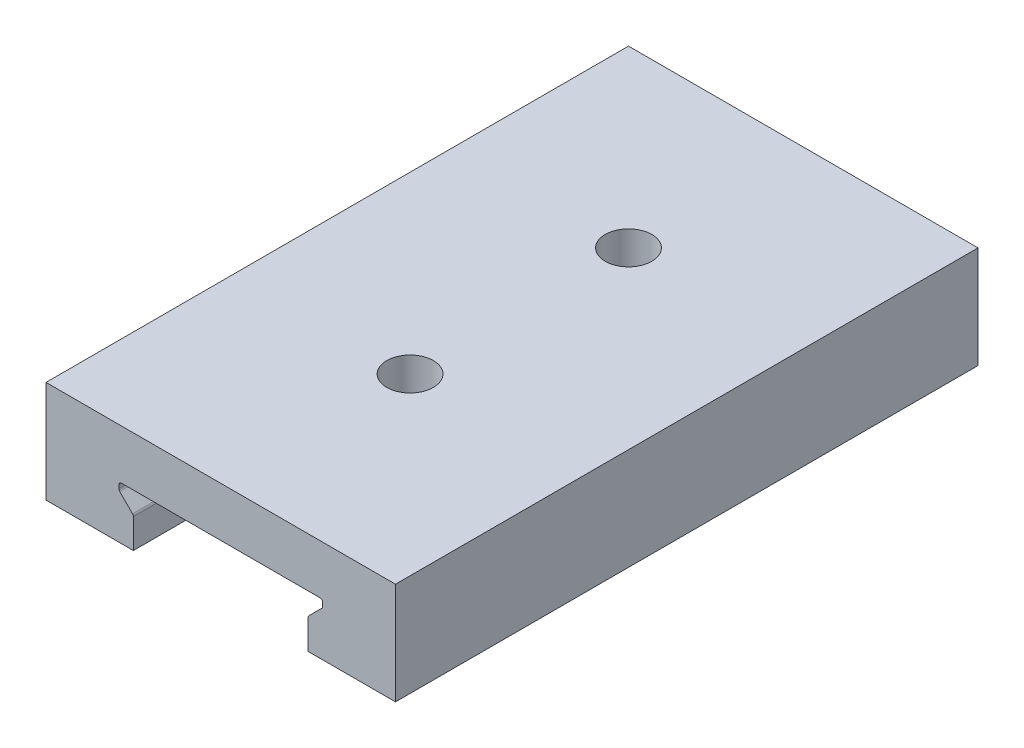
ISO-10303-21;
HEADER;
FILE_DESCRIPTION(('STEP AP214'),'2;1');
FILE_NAME('part.step','',(''),(''),'','','');
FILE_SCHEMA(('AUTOMOTIVE_DESIGN { 1 0 10303 214 1 1 1 1 }'));
ENDSEC;
DATA;
#1=APPLICATION_CONTEXT('core data for automotive mechanical design processes');
#2=APPLICATION_PROTOCOL_DEFINITION('international standard','automotive_design',2000,#1);
#3=PRODUCT_CONTEXT('',#1,'mechanical');
#4=PRODUCT('Part','Part','',(#3));
#5=PRODUCT_RELATED_PRODUCT_CATEGORY('part','',(#4));
#6=PRODUCT_DEFINITION_FORMATION('','',#4);
#7=PRODUCT_DEFINITION_CONTEXT('part definition',#1,'design');
#8=PRODUCT_DEFINITION('design','',#6,#7);
#9=PRODUCT_DEFINITION_SHAPE('','',#8);
#10=(LENGTH_UNIT() NAMED_UNIT(*) SI_UNIT(.MILLI.,.METRE.));
#11=(NAMED_UNIT(*) PLANE_ANGLE_UNIT() SI_UNIT($,.RADIAN.));
#12=(NAMED_UNIT(*) SI_UNIT($,.STERADIAN.) SOLID_ANGLE_UNIT());
#13=UNCERTAINTY_MEASURE_WITH_UNIT(LENGTH_MEASURE(1.E-05),#10,'distance_accuracy_value','');
#14=(GEOMETRIC_REPRESENTATION_CONTEXT(3) GLOBAL_UNCERTAINTY_ASSIGNED_CONTEXT((#13)) GLOBAL_UNIT_ASSIGNED_CONTEXT((#10,
#11,#12)) REPRESENTATION_CONTEXT('',''));
#15=CARTESIAN_POINT('',(0.,0.,0.));
#16=DIRECTION('',(0.,0.,1.));
#17=DIRECTION('',(1.,0.,0.));
#18=AXIS2_PLACEMENT_3D('',#15,#16,#17);
#19=CARTESIAN_POINT('',(-6.,1.,20.));
#20=DIRECTION('',(0.,1.,0.));
#21=DIRECTION('',(0.,0.,1.));
#22=AXIS2_PLACEMENT_3D('',#19,#20,#21);
#23=PLANE('',#22);
#24=DIRECTION('',(0.,0.,1.));
#25=VECTOR('',#24,1.);
#26=CARTESIAN_POINT('',(3.,1.,20.));
#27=LINE('',#26,#25);
#28=CARTESIAN_POINT('',(3.,1.,0.));
#29=VERTEX_POINT('',#28);
#30=CARTESIAN_POINT('',(3.,1.,20.));
#31=VERTEX_POINT('',#30);
#32=EDGE_CURVE('E161',#29,#31,#27,.T.);
#33=ORIENTED_EDGE('',*,*,#32,.F.);
#34=DIRECTION('',(1.,0.,0.));
#35=VECTOR('',#34,1.);
#36=CARTESIAN_POINT('',(-6.,1.,0.));
#37=LINE('',#36,#35);
#38=CARTESIAN_POINT('',(6.,1.,0.));
#39=VERTEX_POINT('',#38);
#40=EDGE_CURVE('E173',#29,#39,#37,.T.);
#41=ORIENTED_EDGE('',*,*,#40,.T.);
#42=DIRECTION('',(0.,0.,-1.));
#43=VECTOR('',#42,1.);
#44=CARTESIAN_POINT('',(6.,1.,20.));
#45=LINE('',#44,#43);
#46=CARTESIAN_POINT('',(6.,1.,20.));
#47=VERTEX_POINT('',#46);
#48=EDGE_CURVE('E211',#47,#39,#45,.T.);
#49=ORIENTED_EDGE('',*,*,#48,.F.);
#50=DIRECTION('',(1.,0.,0.));
#51=VECTOR('',#50,1.);
#52=CARTESIAN_POINT('',(-6.,1.,20.));
#53=LINE('',#52,#51);
#54=EDGE_CURVE('E175',#31,#47,#53,.T.);
#55=ORIENTED_EDGE('',*,*,#54,.F.);
#56=EDGE_LOOP('',(#33,#41,#49,#55));
#57=FACE_BOUND('',#56,.T.);
#58=ADVANCED_FACE('F30',(#57),#23,.F.);
#59=CARTESIAN_POINT('',(-6.,1.,20.));
#60=DIRECTION('',(0.,0.,1.));
#61=DIRECTION('',(1.,0.,0.));
#62=AXIS2_PLACEMENT_3D('',#59,#60,#61);
#63=PLANE('',#62);
#64=DIRECTION('',(0.707106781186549,0.707106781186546,0.));
#65=VECTOR('',#64,1.);
#66=CARTESIAN_POINT('',(3.5,2.55,20.));
#67=LINE('',#66,#65);
#68=CARTESIAN_POINT('',(3.02928932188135,2.07928932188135,20.));
#69=VERTEX_POINT('',#68);
#70=CARTESIAN_POINT('',(3.47071067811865,2.52071067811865,20.));
#71=VERTEX_POINT('',#70);
#72=EDGE_CURVE('E284',#69,#71,#67,.T.);
#73=ORIENTED_EDGE('',*,*,#72,.F.);
#74=CARTESIAN_POINT('',(3.1,2.00857864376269,20.));
#75=DIRECTION('',(0.,0.,1.));
#76=DIRECTION('',(1.,0.,0.));
#77=AXIS2_PLACEMENT_3D('',#74,#75,#76);
#78=CIRCLE('',#77,0.1);
#79=CARTESIAN_POINT('',(3.,2.00857864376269,20.));
#80=VERTEX_POINT('',#79);
#81=EDGE_CURVE('E253',#69,#80,#78,.T.);
#82=ORIENTED_EDGE('',*,*,#81,.T.);
#83=DIRECTION('',(0.,1.,0.));
#84=VECTOR('',#83,1.);
#85=CARTESIAN_POINT('',(3.,2.05,20.));
#86=LINE('',#85,#84);
#87=EDGE_CURVE('E177',#31,#80,#86,.T.);
#88=ORIENTED_EDGE('',*,*,#87,.F.);
#89=ORIENTED_EDGE('',*,*,#54,.T.);
#90=DIRECTION('',(0.,1.,0.));
#91=VECTOR('',#90,1.);
#92=CARTESIAN_POINT('',(6.,4.5,20.));
#93=LINE('',#92,#91);
#94=CARTESIAN_POINT('',(6.,4.5,20.));
#95=VERTEX_POINT('',#94);
#96=EDGE_CURVE('E201',#47,#95,#93,.T.);
#97=ORIENTED_EDGE('',*,*,#96,.T.);
#98=DIRECTION('',(-1.,0.,0.));
#99=VECTOR('',#98,1.);
#100=CARTESIAN_POINT('',(-6.,4.5,20.));
#101=LINE('',#100,#99);
#102=CARTESIAN_POINT('',(-6.,4.5,20.));
#103=VERTEX_POINT('',#102);
#104=EDGE_CURVE('E203',#95,#103,#101,.T.);
#105=ORIENTED_EDGE('',*,*,#104,.T.);
#106=DIRECTION('',(0.,-1.,0.));
#107=VECTOR('',#106,1.);
#108=CARTESIAN_POINT('',(-6.,4.5,20.));
#109=LINE('',#108,#107);
#110=CARTESIAN_POINT('',(-6.,1.,20.));
#111=VERTEX_POINT('',#110);
#112=EDGE_CURVE('E195',#103,#111,#109,.T.);
#113=ORIENTED_EDGE('',*,*,#112,.T.);
#114=CARTESIAN_POINT('',(-3.,1.,20.));
#115=VERTEX_POINT('',#114);
#116=EDGE_CURVE('E198',#111,#115,#53,.T.);
#117=ORIENTED_EDGE('',*,*,#116,.T.);
#118=DIRECTION('',(0.,1.,0.));
#119=VECTOR('',#118,1.);
#120=CARTESIAN_POINT('',(-3.,2.05,20.));
#121=LINE('',#120,#119);
#122=CARTESIAN_POINT('',(-3.,2.00857864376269,20.));
#123=VERTEX_POINT('',#122);
#124=EDGE_CURVE('E296',#115,#123,#121,.T.);
#125=ORIENTED_EDGE('',*,*,#124,.T.);
#126=CARTESIAN_POINT('',(-3.1,2.00857864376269,20.));
#127=DIRECTION('',(0.,0.,1.));
#128=DIRECTION('',(1.,0.,0.));
#129=AXIS2_PLACEMENT_3D('',#126,#127,#128);
#130=CIRCLE('',#129,0.1);
#131=CARTESIAN_POINT('',(-3.02928932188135,2.07928932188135,20.));
#132=VERTEX_POINT('',#131);
#133=EDGE_CURVE('E227',#123,#132,#130,.T.);
#134=ORIENTED_EDGE('',*,*,#133,.T.);
#135=DIRECTION('',(-0.707106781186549,0.707106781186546,0.));
#136=VECTOR('',#135,1.);
#137=CARTESIAN_POINT('',(-3.5,2.55,20.));
#138=LINE('',#137,#136);
#139=CARTESIAN_POINT('',(-3.47071067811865,2.52071067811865,20.));
#140=VERTEX_POINT('',#139);
#141=EDGE_CURVE('E299',#132,#140,#138,.T.);
#142=ORIENTED_EDGE('',*,*,#141,.T.);
#143=CARTESIAN_POINT('',(-3.4,2.59142135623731,20.));
#144=DIRECTION('',(0.,0.,1.));
#145=DIRECTION('',(1.,0.,0.));
#146=AXIS2_PLACEMENT_3D('',#143,#144,#145);
#147=CIRCLE('',#146,0.1);
#148=CARTESIAN_POINT('',(-3.5,2.59142135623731,20.));
#149=VERTEX_POINT('',#148);
#150=EDGE_CURVE('E239',#140,#149,#147,.F.);
#151=ORIENTED_EDGE('',*,*,#150,.T.);
#152=DIRECTION('',(0.,1.,0.));
#153=VECTOR('',#152,1.);
#154=CARTESIAN_POINT('',(-3.5,2.8,20.));
#155=LINE('',#154,#153);
#156=CARTESIAN_POINT('',(-3.5,2.7,20.));
#157=VERTEX_POINT('',#156);
#158=EDGE_CURVE('E302',#149,#157,#155,.T.);
#159=ORIENTED_EDGE('',*,*,#158,.T.);
#160=CARTESIAN_POINT('',(-3.4,2.7,20.));
#161=DIRECTION('',(0.,0.,1.));
#162=DIRECTION('',(1.,0.,0.));
#163=AXIS2_PLACEMENT_3D('',#160,#161,#162);
#164=CIRCLE('',#163,0.1);
#165=CARTESIAN_POINT('',(-3.4,2.8,20.));
#166=VERTEX_POINT('',#165);
#167=EDGE_CURVE('E243',#157,#166,#164,.F.);
#168=ORIENTED_EDGE('',*,*,#167,.T.);
#169=DIRECTION('',(1.,0.,0.));
#170=VECTOR('',#169,1.);
#171=CARTESIAN_POINT('',(0.,2.8,20.));
#172=LINE('',#171,#170);
#173=CARTESIAN_POINT('',(3.4,2.8,20.));
#174=VERTEX_POINT('',#173);
#175=EDGE_CURVE('E305',#166,#174,#172,.T.);
#176=ORIENTED_EDGE('',*,*,#175,.T.);
#177=CARTESIAN_POINT('',(3.4,2.7,20.));
#178=DIRECTION('',(0.,0.,1.));
#179=DIRECTION('',(1.,0.,0.));
#180=AXIS2_PLACEMENT_3D('',#177,#178,#179);
#181=CIRCLE('',#180,0.1);
#182=CARTESIAN_POINT('',(3.5,2.7,20.));
#183=VERTEX_POINT('',#182);
#184=EDGE_CURVE('E11',#174,#183,#181,.F.);
#185=ORIENTED_EDGE('',*,*,#184,.T.);
#186=DIRECTION('',(0.,1.,0.));
#187=VECTOR('',#186,1.);
#188=CARTESIAN_POINT('',(3.5,2.8,20.));
#189=LINE('',#188,#187);
#190=CARTESIAN_POINT('',(3.5,2.59142135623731,20.));
#191=VERTEX_POINT('',#190);
#192=EDGE_CURVE('E167',#191,#183,#189,.T.);
#193=ORIENTED_EDGE('',*,*,#192,.F.);
#194=CARTESIAN_POINT('',(3.4,2.59142135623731,20.));
#195=DIRECTION('',(0.,0.,1.));
#196=DIRECTION('',(1.,0.,0.));
#197=AXIS2_PLACEMENT_3D('',#194,#195,#196);
#198=CIRCLE('',#197,0.1);
#199=EDGE_CURVE('E263',#191,#71,#198,.F.);
#200=ORIENTED_EDGE('',*,*,#199,.T.);
#201=EDGE_LOOP('',(#73,#82,#88,#89,#97,#105,#113,#117,#125,#134,#142,#151,#159,#168,#176,#185,
#193,#200));
#202=FACE_BOUND('',#201,.T.);
#203=ADVANCED_FACE('F313',(#202),#63,.T.);
#204=CARTESIAN_POINT('',(-6.,1.,0.));
#205=DIRECTION('',(0.,0.,1.));
#206=DIRECTION('',(1.,0.,0.));
#207=AXIS2_PLACEMENT_3D('',#204,#205,#206);
#208=PLANE('',#207);
#209=DIRECTION('',(0.,1.,0.));
#210=VECTOR('',#209,1.);
#211=CARTESIAN_POINT('',(3.,2.05,0.));
#212=LINE('',#211,#210);
#213=CARTESIAN_POINT('',(3.,2.00857864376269,0.));
#214=VERTEX_POINT('',#213);
#215=EDGE_CURVE('E157',#29,#214,#212,.T.);
#216=ORIENTED_EDGE('',*,*,#215,.T.);
#217=CARTESIAN_POINT('',(3.1,2.00857864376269,0.));
#218=DIRECTION('',(0.,0.,1.));
#219=DIRECTION('',(1.,0.,0.));
#220=AXIS2_PLACEMENT_3D('',#217,#218,#219);
#221=CIRCLE('',#220,0.1);
#222=CARTESIAN_POINT('',(3.02928932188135,2.07928932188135,0.));
#223=VERTEX_POINT('',#222);
#224=EDGE_CURVE('E246',#214,#223,#221,.F.);
#225=ORIENTED_EDGE('',*,*,#224,.T.);
#226=DIRECTION('',(0.707106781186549,0.707106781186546,0.));
#227=VECTOR('',#226,1.);
#228=CARTESIAN_POINT('',(3.5,2.55,0.));
#229=LINE('',#228,#227);
#230=CARTESIAN_POINT('',(3.47071067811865,2.52071067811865,0.));
#231=VERTEX_POINT('',#230);
#232=EDGE_CURVE('E168',#223,#231,#229,.T.);
#233=ORIENTED_EDGE('',*,*,#232,.T.);
#234=CARTESIAN_POINT('',(3.4,2.59142135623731,0.));
#235=DIRECTION('',(0.,0.,1.));
#236=DIRECTION('',(1.,0.,0.));
#237=AXIS2_PLACEMENT_3D('',#234,#235,#236);
#238=CIRCLE('',#237,0.1);
#239=CARTESIAN_POINT('',(3.5,2.59142135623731,0.));
#240=VERTEX_POINT('',#239);
#241=EDGE_CURVE('E261',#231,#240,#238,.T.);
#242=ORIENTED_EDGE('',*,*,#241,.T.);
#243=DIRECTION('',(0.,1.,0.));
#244=VECTOR('',#243,1.);
#245=CARTESIAN_POINT('',(3.5,2.8,0.));
#246=LINE('',#245,#244);
#247=CARTESIAN_POINT('',(3.5,2.7,0.));
#248=VERTEX_POINT('',#247);
#249=EDGE_CURVE('E267',#240,#248,#246,.T.);
#250=ORIENTED_EDGE('',*,*,#249,.T.);
#251=CARTESIAN_POINT('',(3.4,2.7,0.));
#252=DIRECTION('',(0.,0.,1.));
#253=DIRECTION('',(1.,0.,0.));
#254=AXIS2_PLACEMENT_3D('',#251,#252,#253);
#255=CIRCLE('',#254,0.1);
#256=CARTESIAN_POINT('',(3.4,2.8,0.));
#257=VERTEX_POINT('',#256);
#258=EDGE_CURVE('E39',#248,#257,#255,.T.);
#259=ORIENTED_EDGE('',*,*,#258,.T.);
#260=DIRECTION('',(1.,0.,0.));
#261=VECTOR('',#260,1.);
#262=CARTESIAN_POINT('',(0.,2.8,0.));
#263=LINE('',#262,#261);
#264=CARTESIAN_POINT('',(-3.4,2.8,0.));
#265=VERTEX_POINT('',#264);
#266=EDGE_CURVE('E293',#265,#257,#263,.T.);
#267=ORIENTED_EDGE('',*,*,#266,.F.);
#268=CARTESIAN_POINT('',(-3.4,2.7,0.));
#269=DIRECTION('',(0.,0.,1.));
#270=DIRECTION('',(1.,0.,0.));
#271=AXIS2_PLACEMENT_3D('',#268,#269,#270);
#272=CIRCLE('',#271,0.1);
#273=CARTESIAN_POINT('',(-3.5,2.7,0.));
#274=VERTEX_POINT('',#273);
#275=EDGE_CURVE('E241',#265,#274,#272,.T.);
#276=ORIENTED_EDGE('',*,*,#275,.T.);
#277=DIRECTION('',(0.,1.,0.));
#278=VECTOR('',#277,1.);
#279=CARTESIAN_POINT('',(-3.5,2.8,0.));
#280=LINE('',#279,#278);
#281=CARTESIAN_POINT('',(-3.5,2.59142135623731,0.));
#282=VERTEX_POINT('',#281);
#283=EDGE_CURVE('E290',#282,#274,#280,.T.);
#284=ORIENTED_EDGE('',*,*,#283,.F.);
#285=CARTESIAN_POINT('',(-3.4,2.59142135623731,0.));
#286=DIRECTION('',(0.,0.,1.));
#287=DIRECTION('',(1.,0.,0.));
#288=AXIS2_PLACEMENT_3D('',#285,#286,#287);
#289=CIRCLE('',#288,0.1);
#290=CARTESIAN_POINT('',(-3.47071067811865,2.52071067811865,0.));
#291=VERTEX_POINT('',#290);
#292=EDGE_CURVE('E237',#282,#291,#289,.T.);
#293=ORIENTED_EDGE('',*,*,#292,.T.);
#294=DIRECTION('',(-0.707106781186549,0.707106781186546,0.));
#295=VECTOR('',#294,1.);
#296=CARTESIAN_POINT('',(-3.5,2.55,0.));
#297=LINE('',#296,#295);
#298=CARTESIAN_POINT('',(-3.02928932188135,2.07928932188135,0.));
#299=VERTEX_POINT('',#298);
#300=EDGE_CURVE('E176',#299,#291,#297,.T.);
#301=ORIENTED_EDGE('',*,*,#300,.F.);
#302=CARTESIAN_POINT('',(-3.1,2.00857864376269,0.));
#303=DIRECTION('',(0.,0.,1.));
#304=DIRECTION('',(1.,0.,0.));
#305=AXIS2_PLACEMENT_3D('',#302,#303,#304);
#306=CIRCLE('',#305,0.1);
#307=CARTESIAN_POINT('',(-3.,2.00857864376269,0.));
#308=VERTEX_POINT('',#307);
#309=EDGE_CURVE('E223',#299,#308,#306,.F.);
#310=ORIENTED_EDGE('',*,*,#309,.T.);
#311=DIRECTION('',(0.,-1.,0.));
#312=VECTOR('',#311,1.);
#313=CARTESIAN_POINT('',(-3.,0.999999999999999,0.));
#314=LINE('',#313,#312);
#315=CARTESIAN_POINT('',(-3.,1.,0.));
#316=VERTEX_POINT('',#315);
#317=EDGE_CURVE('E216',#308,#316,#314,.T.);
#318=ORIENTED_EDGE('',*,*,#317,.T.);
#319=CARTESIAN_POINT('',(-6.,1.,0.));
#320=VERTEX_POINT('',#319);
#321=EDGE_CURVE('E183',#320,#316,#37,.T.);
#322=ORIENTED_EDGE('',*,*,#321,.F.);
#323=DIRECTION('',(0.,-1.,0.));
#324=VECTOR('',#323,1.);
#325=CARTESIAN_POINT('',(-6.,4.5,0.));
#326=LINE('',#325,#324);
#327=CARTESIAN_POINT('',(-6.,4.5,0.));
#328=VERTEX_POINT('',#327);
#329=EDGE_CURVE('E184',#328,#320,#326,.T.);
#330=ORIENTED_EDGE('',*,*,#329,.F.);
#331=DIRECTION('',(-1.,0.,0.));
#332=VECTOR('',#331,1.);
#333=CARTESIAN_POINT('',(-6.,4.5,0.));
#334=LINE('',#333,#332);
#335=CARTESIAN_POINT('',(6.,4.5,0.));
#336=VERTEX_POINT('',#335);
#337=EDGE_CURVE('E193',#336,#328,#334,.T.);
#338=ORIENTED_EDGE('',*,*,#337,.F.);
#339=DIRECTION('',(0.,1.,0.));
#340=VECTOR('',#339,1.);
#341=CARTESIAN_POINT('',(6.,4.5,0.));
#342=LINE('',#341,#340);
#343=EDGE_CURVE('E182',#39,#336,#342,.T.);
#344=ORIENTED_EDGE('',*,*,#343,.F.);
#345=ORIENTED_EDGE('',*,*,#40,.F.);
#346=EDGE_LOOP('',(#216,#225,#233,#242,#250,#259,#267,#276,#284,#293,#301,#310,#318,#322,#330,
#338,#344,#345));
#347=FACE_BOUND('',#346,.T.);
#348=ADVANCED_FACE('F180',(#347),#208,.F.);
#349=CARTESIAN_POINT('',(-6.,4.5,20.));
#350=DIRECTION('',(1.,0.,0.));
#351=DIRECTION('',(0.,0.,-1.));
#352=AXIS2_PLACEMENT_3D('',#349,#350,#351);
#353=PLANE('',#352);
#354=ORIENTED_EDGE('',*,*,#329,.T.);
#355=DIRECTION('',(0.,0.,-1.));
#356=VECTOR('',#355,1.);
#357=CARTESIAN_POINT('',(-6.,1.,20.));
#358=LINE('',#357,#356);
#359=EDGE_CURVE('E213',#111,#320,#358,.T.);
#360=ORIENTED_EDGE('',*,*,#359,.F.);
#361=ORIENTED_EDGE('',*,*,#112,.F.);
#362=DIRECTION('',(0.,0.,-1.));
#363=VECTOR('',#362,1.);
#364=CARTESIAN_POINT('',(-6.,4.5,20.));
#365=LINE('',#364,#363);
#366=EDGE_CURVE('E205',#103,#328,#365,.T.);
#367=ORIENTED_EDGE('',*,*,#366,.T.);
#368=EDGE_LOOP('',(#354,#360,#361,#367));
#369=FACE_BOUND('',#368,.T.);
#370=ADVANCED_FACE('F32',(#369),#353,.F.);
#371=ORIENTED_EDGE('',*,*,#321,.T.);
#372=DIRECTION('',(0.,0.,1.));
#373=VECTOR('',#372,1.);
#374=CARTESIAN_POINT('',(-3.,1.,20.));
#375=LINE('',#374,#373);
#376=EDGE_CURVE('E188',#316,#115,#375,.T.);
#377=ORIENTED_EDGE('',*,*,#376,.T.);
#378=ORIENTED_EDGE('',*,*,#116,.F.);
#379=ORIENTED_EDGE('',*,*,#359,.T.);
#380=EDGE_LOOP('',(#371,#377,#378,#379));
#381=FACE_BOUND('',#380,.T.);
#382=ADVANCED_FACE('F309',(#381),#23,.F.);
#383=CARTESIAN_POINT('',(6.,4.5,20.));
#384=DIRECTION('',(-1.,0.,0.));
#385=DIRECTION('',(0.,0.,1.));
#386=AXIS2_PLACEMENT_3D('',#383,#384,#385);
#387=PLANE('',#386);
#388=ORIENTED_EDGE('',*,*,#343,.T.);
#389=DIRECTION('',(0.,0.,-1.));
#390=VECTOR('',#389,1.);
#391=CARTESIAN_POINT('',(6.,4.5,20.));
#392=LINE('',#391,#390);
#393=EDGE_CURVE('E208',#95,#336,#392,.T.);
#394=ORIENTED_EDGE('',*,*,#393,.F.);
#395=ORIENTED_EDGE('',*,*,#96,.F.);
#396=ORIENTED_EDGE('',*,*,#48,.T.);
#397=EDGE_LOOP('',(#388,#394,#395,#396));
#398=FACE_BOUND('',#397,.T.);
#399=ADVANCED_FACE('F380',(#398),#387,.F.);
#400=CARTESIAN_POINT('',(-6.,4.5,20.));
#401=DIRECTION('',(0.,-1.,0.));
#402=DIRECTION('',(0.,0.,-1.));
#403=AXIS2_PLACEMENT_3D('',#400,#401,#402);
#404=PLANE('',#403);
#405=CARTESIAN_POINT('',(0.,4.5,6.));
#406=DIRECTION('',(0.,1.,0.));
#407=DIRECTION('',(0.,0.,1.));
#408=AXIS2_PLACEMENT_3D('',#405,#406,#407);
#409=CIRCLE('',#408,0.799999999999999);
#410=CARTESIAN_POINT('',(0.,4.5,6.8));
#411=VERTEX_POINT('',#410);
#412=EDGE_CURVE('E278',#411,#411,#409,.T.);
#413=ORIENTED_EDGE('',*,*,#412,.F.);
#414=EDGE_LOOP('',(#413));
#415=FACE_BOUND('',#414,.T.);
#416=CARTESIAN_POINT('',(0.,4.5,13.5));
#417=DIRECTION('',(0.,1.,0.));
#418=DIRECTION('',(0.,0.,1.));
#419=AXIS2_PLACEMENT_3D('',#416,#417,#418);
#420=CIRCLE('',#419,0.799999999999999);
#421=CARTESIAN_POINT('',(0.,4.5,14.3));
#422=VERTEX_POINT('',#421);
#423=EDGE_CURVE('E268',#422,#422,#420,.T.);
#424=ORIENTED_EDGE('',*,*,#423,.F.);
#425=EDGE_LOOP('',(#424));
#426=FACE_BOUND('',#425,.T.);
#427=ORIENTED_EDGE('',*,*,#337,.T.);
#428=ORIENTED_EDGE('',*,*,#366,.F.);
#429=ORIENTED_EDGE('',*,*,#104,.F.);
#430=ORIENTED_EDGE('',*,*,#393,.T.);
#431=EDGE_LOOP('',(#427,#428,#429,#430));
#432=FACE_BOUND('',#431,.T.);
#433=ADVANCED_FACE('F385',(#415,#426,#432),#404,.F.);
#434=CARTESIAN_POINT('',(-3.,2.05,20.));
#435=DIRECTION('',(-1.,0.,0.));
#436=DIRECTION('',(0.,-1.,0.));
#437=AXIS2_PLACEMENT_3D('',#434,#435,#436);
#438=PLANE('',#437);
#439=ORIENTED_EDGE('',*,*,#317,.F.);
#440=DIRECTION('',(0.,0.,-1.));
#441=VECTOR('',#440,1.);
#442=CARTESIAN_POINT('',(-3.,2.00857864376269,20.));
#443=LINE('',#442,#441);
#444=EDGE_CURVE('E225',#308,#123,#443,.F.);
#445=ORIENTED_EDGE('',*,*,#444,.T.);
#446=ORIENTED_EDGE('',*,*,#124,.F.);
#447=ORIENTED_EDGE('',*,*,#376,.F.);
#448=EDGE_LOOP('',(#439,#445,#446,#447));
#449=FACE_BOUND('',#448,.T.);
#450=ADVANCED_FACE('F323',(#449),#438,.F.);
#451=CARTESIAN_POINT('',(0.,2.8,20.));
#452=DIRECTION('',(0.,1.,0.));
#453=DIRECTION('',(0.,0.,1.));
#454=AXIS2_PLACEMENT_3D('',#451,#452,#453);
#455=PLANE('',#454);
#456=CARTESIAN_POINT('',(0.,2.8,6.));
#457=DIRECTION('',(0.,1.,0.));
#458=DIRECTION('',(0.,0.,1.));
#459=AXIS2_PLACEMENT_3D('',#456,#457,#458);
#460=CIRCLE('',#459,0.799999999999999);
#461=CARTESIAN_POINT('',(0.,2.8,6.8));
#462=VERTEX_POINT('',#461);
#463=EDGE_CURVE('E34',#462,#462,#460,.T.);
#464=ORIENTED_EDGE('',*,*,#463,.T.);
#465=EDGE_LOOP('',(#464));
#466=FACE_BOUND('',#465,.T.);
#467=CARTESIAN_POINT('',(0.,2.8,13.5));
#468=DIRECTION('',(0.,1.,0.));
#469=DIRECTION('',(0.,0.,1.));
#470=AXIS2_PLACEMENT_3D('',#467,#468,#469);
#471=CIRCLE('',#470,0.799999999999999);
#472=CARTESIAN_POINT('',(0.,2.8,14.3));
#473=VERTEX_POINT('',#472);
#474=EDGE_CURVE('E265',#473,#473,#471,.T.);
#475=ORIENTED_EDGE('',*,*,#474,.T.);
#476=EDGE_LOOP('',(#475));
#477=FACE_BOUND('',#476,.T.);
#478=ORIENTED_EDGE('',*,*,#266,.T.);
#479=DIRECTION('',(0.,0.,-1.));
#480=VECTOR('',#479,1.);
#481=CARTESIAN_POINT('',(3.4,2.8,20.));
#482=LINE('',#481,#480);
#483=EDGE_CURVE('E259',#257,#174,#482,.F.);
#484=ORIENTED_EDGE('',*,*,#483,.T.);
#485=ORIENTED_EDGE('',*,*,#175,.F.);
#486=DIRECTION('',(0.,0.,-1.));
#487=VECTOR('',#486,1.);
#488=CARTESIAN_POINT('',(-3.4,2.8,0.));
#489=LINE('',#488,#487);
#490=EDGE_CURVE('E234',#166,#265,#489,.T.);
#491=ORIENTED_EDGE('',*,*,#490,.T.);
#492=EDGE_LOOP('',(#478,#484,#485,#491));
#493=FACE_BOUND('',#492,.T.);
#494=ADVANCED_FACE('F346',(#466,#477,#493),#455,.F.);
#495=CARTESIAN_POINT('',(-3.5,2.8,20.));
#496=DIRECTION('',(-1.,0.,0.));
#497=DIRECTION('',(0.,0.,1.));
#498=AXIS2_PLACEMENT_3D('',#495,#496,#497);
#499=PLANE('',#498);
#500=ORIENTED_EDGE('',*,*,#158,.F.);
#501=DIRECTION('',(0.,0.,-1.));
#502=VECTOR('',#501,1.);
#503=CARTESIAN_POINT('',(-3.5,2.59142135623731,0.));
#504=LINE('',#503,#502);
#505=EDGE_CURVE('E231',#149,#282,#504,.T.);
#506=ORIENTED_EDGE('',*,*,#505,.T.);
#507=ORIENTED_EDGE('',*,*,#283,.T.);
#508=DIRECTION('',(0.,0.,-1.));
#509=VECTOR('',#508,1.);
#510=CARTESIAN_POINT('',(-3.5,2.7,20.));
#511=LINE('',#510,#509);
#512=EDGE_CURVE('E229',#274,#157,#511,.F.);
#513=ORIENTED_EDGE('',*,*,#512,.T.);
#514=EDGE_LOOP('',(#500,#506,#507,#513));
#515=FACE_BOUND('',#514,.T.);
#516=ADVANCED_FACE('F338',(#515),#499,.F.);
#517=CARTESIAN_POINT('',(-3.5,2.55,20.));
#518=DIRECTION('',(-0.707106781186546,-0.707106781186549,0.));
#519=DIRECTION('',(0.707106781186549,-0.707106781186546,0.));
#520=AXIS2_PLACEMENT_3D('',#517,#518,#519);
#521=PLANE('',#520);
#522=ORIENTED_EDGE('',*,*,#141,.F.);
#523=DIRECTION('',(0.,0.,-1.));
#524=VECTOR('',#523,1.);
#525=CARTESIAN_POINT('',(-3.02928932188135,2.07928932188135,20.));
#526=LINE('',#525,#524);
#527=EDGE_CURVE('E220',#132,#299,#526,.T.);
#528=ORIENTED_EDGE('',*,*,#527,.T.);
#529=ORIENTED_EDGE('',*,*,#300,.T.);
#530=DIRECTION('',(0.,0.,-1.));
#531=VECTOR('',#530,1.);
#532=CARTESIAN_POINT('',(-3.47071067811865,2.52071067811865,20.));
#533=LINE('',#532,#531);
#534=EDGE_CURVE('E218',#291,#140,#533,.F.);
#535=ORIENTED_EDGE('',*,*,#534,.T.);
#536=EDGE_LOOP('',(#522,#528,#529,#535));
#537=FACE_BOUND('',#536,.T.);
#538=ADVANCED_FACE('F330',(#537),#521,.F.);
#539=CARTESIAN_POINT('',(-3.1,2.00857864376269,20.));
#540=DIRECTION('',(0.,0.,-1.));
#541=DIRECTION('',(-1.,0.,0.));
#542=AXIS2_PLACEMENT_3D('',#539,#540,#541);
#543=CYLINDRICAL_SURFACE('',#542,0.1);
#544=ORIENTED_EDGE('',*,*,#133,.F.);
#545=ORIENTED_EDGE('',*,*,#444,.F.);
#546=ORIENTED_EDGE('',*,*,#309,.F.);
#547=ORIENTED_EDGE('',*,*,#527,.F.);
#548=EDGE_LOOP('',(#544,#545,#546,#547));
#549=FACE_BOUND('',#548,.T.);
#550=ADVANCED_FACE('F325',(#549),#543,.T.);
#551=CARTESIAN_POINT('',(-3.4,2.59142135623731,20.));
#552=DIRECTION('',(0.,0.,1.));
#553=DIRECTION('',(1.,0.,0.));
#554=AXIS2_PLACEMENT_3D('',#551,#552,#553);
#555=CYLINDRICAL_SURFACE('',#554,0.1);
#556=ORIENTED_EDGE('',*,*,#150,.F.);
#557=ORIENTED_EDGE('',*,*,#534,.F.);
#558=ORIENTED_EDGE('',*,*,#292,.F.);
#559=ORIENTED_EDGE('',*,*,#505,.F.);
#560=EDGE_LOOP('',(#556,#557,#558,#559));
#561=FACE_BOUND('',#560,.T.);
#562=ADVANCED_FACE('F333',(#561),#555,.F.);
#563=CARTESIAN_POINT('',(-3.4,2.7,20.));
#564=DIRECTION('',(0.,0.,1.));
#565=DIRECTION('',(1.,0.,0.));
#566=AXIS2_PLACEMENT_3D('',#563,#564,#565);
#567=CYLINDRICAL_SURFACE('',#566,0.1);
#568=ORIENTED_EDGE('',*,*,#167,.F.);
#569=ORIENTED_EDGE('',*,*,#512,.F.);
#570=ORIENTED_EDGE('',*,*,#275,.F.);
#571=ORIENTED_EDGE('',*,*,#490,.F.);
#572=EDGE_LOOP('',(#568,#569,#570,#571));
#573=FACE_BOUND('',#572,.T.);
#574=ADVANCED_FACE('F342',(#573),#567,.F.);
#575=CARTESIAN_POINT('',(3.,2.05,20.));
#576=DIRECTION('',(-1.,0.,0.));
#577=DIRECTION('',(0.,-1.,0.));
#578=AXIS2_PLACEMENT_3D('',#575,#576,#577);
#579=PLANE('',#578);
#580=ORIENTED_EDGE('',*,*,#87,.T.);
#581=DIRECTION('',(0.,0.,-1.));
#582=VECTOR('',#581,1.);
#583=CARTESIAN_POINT('',(3.,2.00857864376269,20.));
#584=LINE('',#583,#582);
#585=EDGE_CURVE('E164',#80,#214,#584,.T.);
#586=ORIENTED_EDGE('',*,*,#585,.T.);
#587=ORIENTED_EDGE('',*,*,#215,.F.);
#588=ORIENTED_EDGE('',*,*,#32,.T.);
#589=EDGE_LOOP('',(#580,#586,#587,#588));
#590=FACE_BOUND('',#589,.T.);
#591=ADVANCED_FACE('F160',(#590),#579,.T.);
#592=CARTESIAN_POINT('',(3.5,2.55,20.));
#593=DIRECTION('',(-0.707106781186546,0.707106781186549,0.));
#594=DIRECTION('',(-0.707106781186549,-0.707106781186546,0.));
#595=AXIS2_PLACEMENT_3D('',#592,#593,#594);
#596=PLANE('',#595);
#597=ORIENTED_EDGE('',*,*,#232,.F.);
#598=DIRECTION('',(0.,0.,-1.));
#599=VECTOR('',#598,1.);
#600=CARTESIAN_POINT('',(3.02928932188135,2.07928932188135,20.));
#601=LINE('',#600,#599);
#602=EDGE_CURVE('E251',#223,#69,#601,.F.);
#603=ORIENTED_EDGE('',*,*,#602,.T.);
#604=ORIENTED_EDGE('',*,*,#72,.T.);
#605=DIRECTION('',(0.,0.,-1.));
#606=VECTOR('',#605,1.);
#607=CARTESIAN_POINT('',(3.47071067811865,2.52071067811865,0.));
#608=LINE('',#607,#606);
#609=EDGE_CURVE('E248',#71,#231,#608,.T.);
#610=ORIENTED_EDGE('',*,*,#609,.T.);
#611=EDGE_LOOP('',(#597,#603,#604,#610));
#612=FACE_BOUND('',#611,.T.);
#613=ADVANCED_FACE('F359',(#612),#596,.T.);
#614=CARTESIAN_POINT('',(3.5,2.8,20.));
#615=DIRECTION('',(-1.,0.,0.));
#616=DIRECTION('',(0.,0.,1.));
#617=AXIS2_PLACEMENT_3D('',#614,#615,#616);
#618=PLANE('',#617);
#619=ORIENTED_EDGE('',*,*,#249,.F.);
#620=DIRECTION('',(0.,0.,-1.));
#621=VECTOR('',#620,1.);
#622=CARTESIAN_POINT('',(3.5,2.59142135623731,20.));
#623=LINE('',#622,#621);
#624=EDGE_CURVE('E52',#240,#191,#623,.F.);
#625=ORIENTED_EDGE('',*,*,#624,.T.);
#626=ORIENTED_EDGE('',*,*,#192,.T.);
#627=DIRECTION('',(0.,0.,-1.));
#628=VECTOR('',#627,1.);
#629=CARTESIAN_POINT('',(3.5,2.7,20.));
#630=LINE('',#629,#628);
#631=EDGE_CURVE('E255',#183,#248,#630,.T.);
#632=ORIENTED_EDGE('',*,*,#631,.T.);
#633=EDGE_LOOP('',(#619,#625,#626,#632));
#634=FACE_BOUND('',#633,.T.);
#635=ADVANCED_FACE('F352',(#634),#618,.T.);
#636=CARTESIAN_POINT('',(3.1,2.00857864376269,20.));
#637=DIRECTION('',(0.,0.,-1.));
#638=DIRECTION('',(-1.,0.,0.));
#639=AXIS2_PLACEMENT_3D('',#636,#637,#638);
#640=CYLINDRICAL_SURFACE('',#639,0.1);
#641=ORIENTED_EDGE('',*,*,#81,.F.);
#642=ORIENTED_EDGE('',*,*,#602,.F.);
#643=ORIENTED_EDGE('',*,*,#224,.F.);
#644=ORIENTED_EDGE('',*,*,#585,.F.);
#645=EDGE_LOOP('',(#641,#642,#643,#644));
#646=FACE_BOUND('',#645,.T.);
#647=ADVANCED_FACE('F363',(#646),#640,.T.);
#648=CARTESIAN_POINT('',(3.4,2.59142135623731,20.));
#649=DIRECTION('',(0.,0.,1.));
#650=DIRECTION('',(1.,0.,0.));
#651=AXIS2_PLACEMENT_3D('',#648,#649,#650);
#652=CYLINDRICAL_SURFACE('',#651,0.1);
#653=ORIENTED_EDGE('',*,*,#199,.F.);
#654=ORIENTED_EDGE('',*,*,#624,.F.);
#655=ORIENTED_EDGE('',*,*,#241,.F.);
#656=ORIENTED_EDGE('',*,*,#609,.F.);
#657=EDGE_LOOP('',(#653,#654,#655,#656));
#658=FACE_BOUND('',#657,.T.);
#659=ADVANCED_FACE('F357',(#658),#652,.F.);
#660=CARTESIAN_POINT('',(3.4,2.7,20.));
#661=DIRECTION('',(0.,0.,-1.));
#662=DIRECTION('',(-1.,0.,0.));
#663=AXIS2_PLACEMENT_3D('',#660,#661,#662);
#664=CYLINDRICAL_SURFACE('',#663,0.1);
#665=ORIENTED_EDGE('',*,*,#184,.F.);
#666=ORIENTED_EDGE('',*,*,#483,.F.);
#667=ORIENTED_EDGE('',*,*,#258,.F.);
#668=ORIENTED_EDGE('',*,*,#631,.F.);
#669=EDGE_LOOP('',(#665,#666,#667,#668));
#670=FACE_BOUND('',#669,.T.);
#671=ADVANCED_FACE('F350',(#670),#664,.F.);
#672=CARTESIAN_POINT('',(0.,4.5,13.5));
#673=DIRECTION('',(0.,1.,0.));
#674=DIRECTION('',(0.,0.,1.));
#675=AXIS2_PLACEMENT_3D('',#672,#673,#674);
#676=CYLINDRICAL_SURFACE('',#675,0.799999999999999);
#677=ORIENTED_EDGE('',*,*,#423,.T.);
#678=EDGE_LOOP('',(#677));
#679=FACE_BOUND('',#678,.T.);
#680=ORIENTED_EDGE('',*,*,#474,.F.);
#681=EDGE_LOOP('',(#680));
#682=FACE_BOUND('',#681,.T.);
#683=ADVANCED_FACE('F411',(#679,#682),#676,.F.);
#684=CARTESIAN_POINT('',(0.,4.5,6.));
#685=DIRECTION('',(0.,1.,0.));
#686=DIRECTION('',(0.,0.,1.));
#687=AXIS2_PLACEMENT_3D('',#684,#685,#686);
#688=CYLINDRICAL_SURFACE('',#687,0.799999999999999);
#689=ORIENTED_EDGE('',*,*,#412,.T.);
#690=EDGE_LOOP('',(#689));
#691=FACE_BOUND('',#690,.T.);
#692=ORIENTED_EDGE('',*,*,#463,.F.);
#693=EDGE_LOOP('',(#692));
#694=FACE_BOUND('',#693,.T.);
#695=ADVANCED_FACE('F408',(#691,#694),#688,.F.);
#696=CLOSED_SHELL('',(#58,#203,#348,#370,#382,#399,#433,#450,#494,#516,#538,#550,#562,#574,#591,
#613,#635,#647,#659,#671,#683,#695));
#697=MANIFOLD_SOLID_BREP('B2',#696);
#698=ADVANCED_BREP_SHAPE_REPRESENTATION('',(#18,#697),#14);
#699=SHAPE_DEFINITION_REPRESENTATION(#9,#698);
ENDSEC;
END-ISO-10303-21;
